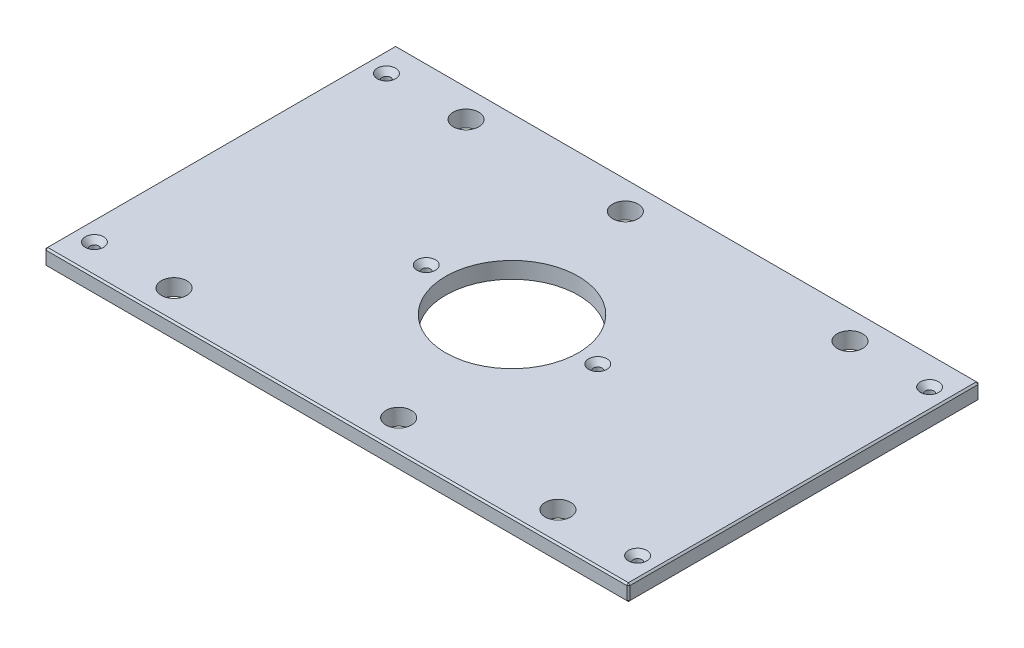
from build123d import *

# Parameters (mm, degrees)
SKETCH1_W                                        = 454.025
SKETCH1_H                                        = 273.05
BOSS_EXTRUDE1_DEPTH                              = 12.7
SKETCH13_R                                       = 51.562
CUT_EXTRUDE6_DEPTH                               = 266.207542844
F_25_32_0_78125_DIAMETER_HOLE1_D                 = 19.84375
CHAMFER2_SIZE                                    = 1.27
CSK_FOR_1_4_FLAT_HEAD_MACHINE_SCREW1_D           = 6.7564
CSK_FOR_1_4_FLAT_HEAD_MACHINE_SCREW1_CSINK_D     = 14.2748
CSK_FOR_1_4_FLAT_HEAD_MACHINE_SCREW1_CSINK_ANGLE = 82


with BuildPart() as part:
    # Sketch1 → Boss-Extrude1 (new body)
    with BuildSketch(Plane(origin=(0, 0, 0), x_dir=(1, 0, 0), z_dir=(0, 1, 0))):
        Rectangle(SKETCH1_W, SKETCH1_H)
    extrude(amount=BOSS_EXTRUDE1_DEPTH)

    # Sketch13 → Cut-Extrude6 (cut, through all)
    with BuildSketch(Plane(origin=(0, 12.7, 0), x_dir=(1, 0, 0), z_dir=(0, 1, 0))):
        with Locations(Location((0, 0, 0), (0, 0, 270))):
            Circle(SKETCH13_R)
    extrude(amount=-CUT_EXTRUDE6_DEPTH, mode=Mode.SUBTRACT)

    # 25_32 _0.78125_ Diameter Hole1 (through all)
    with Locations(Plane(origin=(0, 12.7, 0), x_dir=(1, 0, 0), z_dir=(0, 1, 0))):
        with Locations((149.225, 113.50498), (-149.225, 113.50498), (149.225, -113.50498), (-149.225, -113.50498), (-25.4, 113.50498), (25.4, -113.50498)):
            Hole(F_25_32_0_78125_DIAMETER_HOLE1_D / 2)

    # Chamfer2
    chamfer2_edges = [part.edges().sort_by_distance(p)[0] for p in [
        (227.0125, 12.7, 0),
        (0, 12.7, -136.525),
        (-227.0125, 12.7, 0),
        (0, 0, -136.525),
        (227.0125, 0, 0),
        (0, 0, 136.525),
        (-227.0125, 0, 0),
        (0, 12.7, 136.525),
        (-227.0125, 6.35, -136.525),
        (227.0125, 6.35, -136.525),
        (227.0125, 6.35, 136.525),
        (-227.0125, 6.35, 136.525),
    ]]
    chamfer(chamfer2_edges, length=CHAMFER2_SIZE)

    # CSK for 1_4 Flat Head Machine Screw1 (through all)
    with Locations(Plane(origin=(0, 12.7, 0), x_dir=(1, 0, 0), z_dir=(0, 1, 0))):
        with Locations((211.1375, 113.50498), (211.1375, -113.50498), (-211.1375, -113.50498), (-66.675, 0), (66.675, 0), (-211.1375, 113.50498), (-149.225, 113.50498), (-149.225, -113.50498)):
            CounterSinkHole(CSK_FOR_1_4_FLAT_HEAD_MACHINE_SCREW1_D / 2, CSK_FOR_1_4_FLAT_HEAD_MACHINE_SCREW1_CSINK_D / 2, counter_sink_angle=CSK_FOR_1_4_FLAT_HEAD_MACHINE_SCREW1_CSINK_ANGLE)


solid = part.part
